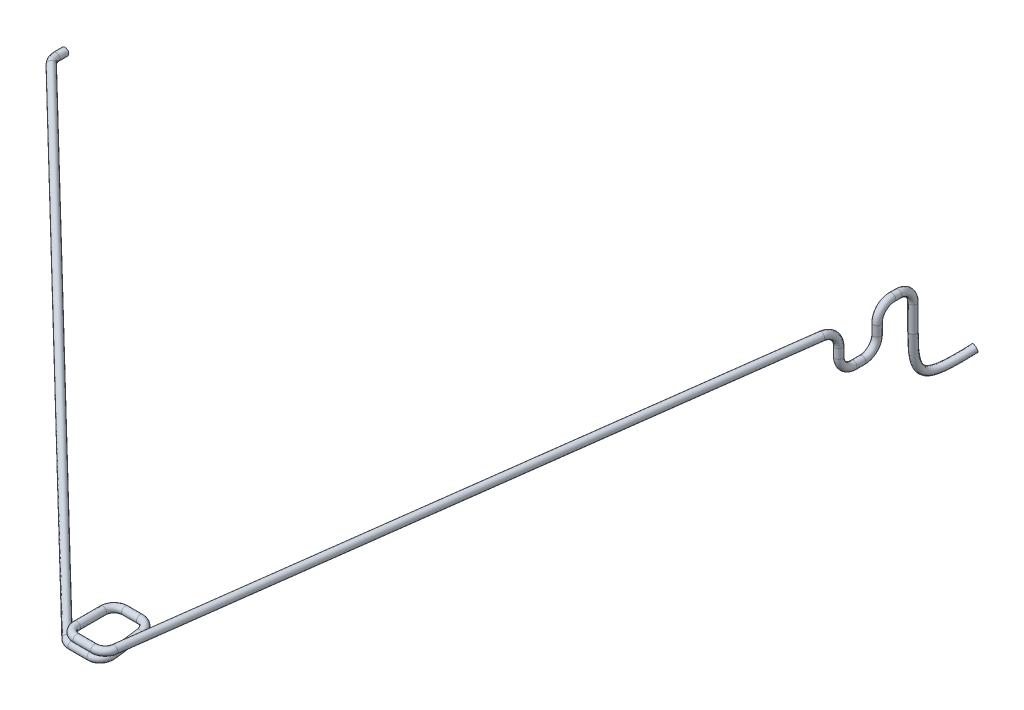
ISO-10303-21;
HEADER;
FILE_DESCRIPTION(('STEP AP214'),'2;1');
FILE_NAME('part.step','',(''),(''),'','','');
FILE_SCHEMA(('AUTOMOTIVE_DESIGN { 1 0 10303 214 1 1 1 1 }'));
ENDSEC;
DATA;
#1=APPLICATION_CONTEXT('core data for automotive mechanical design processes');
#2=APPLICATION_PROTOCOL_DEFINITION('international standard','automotive_design',2000,#1);
#3=PRODUCT_CONTEXT('',#1,'mechanical');
#4=PRODUCT('Part','Part','',(#3));
#5=PRODUCT_RELATED_PRODUCT_CATEGORY('part','',(#4));
#6=PRODUCT_DEFINITION_FORMATION('','',#4);
#7=PRODUCT_DEFINITION_CONTEXT('part definition',#1,'design');
#8=PRODUCT_DEFINITION('design','',#6,#7);
#9=PRODUCT_DEFINITION_SHAPE('','',#8);
#10=(LENGTH_UNIT() NAMED_UNIT(*) SI_UNIT(.MILLI.,.METRE.));
#11=(NAMED_UNIT(*) PLANE_ANGLE_UNIT() SI_UNIT($,.RADIAN.));
#12=(NAMED_UNIT(*) SI_UNIT($,.STERADIAN.) SOLID_ANGLE_UNIT());
#13=UNCERTAINTY_MEASURE_WITH_UNIT(LENGTH_MEASURE(1.E-05),#10,'distance_accuracy_value','');
#14=(GEOMETRIC_REPRESENTATION_CONTEXT(3) GLOBAL_UNCERTAINTY_ASSIGNED_CONTEXT((#13)) GLOBAL_UNIT_ASSIGNED_CONTEXT((#10,
#11,#12)) REPRESENTATION_CONTEXT('',''));
#15=CARTESIAN_POINT('',(0.,0.,0.));
#16=DIRECTION('',(0.,0.,1.));
#17=DIRECTION('',(1.,0.,0.));
#18=AXIS2_PLACEMENT_3D('',#15,#16,#17);
#19=CARTESIAN_POINT('',(278.397258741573,11.9978166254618,53.5192132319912));
#20=DIRECTION('',(0.,-1.,0.));
#21=DIRECTION('',(0.,0.,-1.));
#22=AXIS2_PLACEMENT_3D('',#19,#20,#21);
#23=CYLINDRICAL_SURFACE('',#22,1.00000000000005);
#24=CARTESIAN_POINT('',(278.397258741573,11.9978166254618,53.5192132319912));
#25=DIRECTION('',(1.22196340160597E-13,1.,-6.34587028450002E-13));
#26=DIRECTION('',(0.,6.34587028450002E-13,1.));
#27=AXIS2_PLACEMENT_3D('',#24,#25,#26);
#28=CIRCLE('',#27,1.00000000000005);
#29=CARTESIAN_POINT('',(278.397258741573,11.9978166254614,52.5192132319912));
#30=VERTEX_POINT('',#29);
#31=EDGE_CURVE('E32',#30,#30,#28,.T.);
#32=ORIENTED_EDGE('',*,*,#31,.F.);
#33=EDGE_LOOP('',(#32));
#34=FACE_BOUND('',#33,.T.);
#35=CARTESIAN_POINT('',(278.397258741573,5.19926221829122,53.5192132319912));
#36=DIRECTION('',(-0.0227539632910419,-0.999319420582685,-0.0290336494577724));
#37=DIRECTION('',(0.616425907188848,-0.0368876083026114,0.786548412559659));
#38=AXIS2_PLACEMENT_3D('',#35,#36,#37);
#39=ELLIPSE('',#38,1.00068104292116,1.00000000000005);
#40=CARTESIAN_POINT('',(279.014104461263,5.1623494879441,54.3062973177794));
#41=VERTEX_POINT('',#40);
#42=EDGE_CURVE('E11',#41,#41,#39,.T.);
#43=ORIENTED_EDGE('',*,*,#42,.F.);
#44=EDGE_LOOP('',(#43));
#45=FACE_BOUND('',#44,.T.);
#46=ADVANCED_FACE('F26',(#34,#45),#23,.T.);
#47=CARTESIAN_POINT('',(278.397258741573,11.9978166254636,57.5192132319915));
#48=DIRECTION('',(-1.,0.,0.));
#49=DIRECTION('',(0.,0.,1.));
#50=AXIS2_PLACEMENT_3D('',#47,#48,#49);
#51=TOROIDAL_SURFACE('',#50,4.00000000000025,1.00000000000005);
#52=CARTESIAN_POINT('',(278.397258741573,15.9978166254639,57.5192132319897));
#53=DIRECTION('',(1.22196340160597E-13,6.34648258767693E-13,1.));
#54=DIRECTION('',(0.,-1.,6.34648258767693E-13));
#55=AXIS2_PLACEMENT_3D('',#52,#53,#54);
#56=CIRCLE('',#55,1.00000000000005);
#57=CARTESIAN_POINT('',(278.397258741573,16.9978166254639,57.5192132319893));
#58=VERTEX_POINT('',#57);
#59=EDGE_CURVE('E36',#58,#58,#56,.T.);
#60=CARTESIAN_POINT('',(278.397258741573,11.9978166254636,57.5192132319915));
#61=DIRECTION('',(-1.,0.,0.));
#62=DIRECTION('',(0.,0.,1.));
#63=AXIS2_PLACEMENT_3D('',#60,#61,#62);
#64=CIRCLE('',#63,5.0000000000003);
#65=EDGE_CURVE('',#58,#30,#64,.T.);
#66=ORIENTED_EDGE('',*,*,#59,.F.);
#67=ORIENTED_EDGE('',*,*,#31,.T.);
#68=ORIENTED_EDGE('',*,*,#65,.T.);
#69=ORIENTED_EDGE('',*,*,#65,.F.);
#70=EDGE_LOOP('',(#66,#68,#67,#69));
#71=FACE_BOUND('',#70,.T.);
#72=ADVANCED_FACE('F140',(#71),#51,.T.);
#73=CARTESIAN_POINT('',(278.397258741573,15.9978166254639,59.1950501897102));
#74=DIRECTION('',(0.,0.,-1.));
#75=DIRECTION('',(-1.,0.,0.));
#76=AXIS2_PLACEMENT_3D('',#73,#74,#75);
#77=CYLINDRICAL_SURFACE('',#76,1.00000000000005);
#78=CARTESIAN_POINT('',(278.397258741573,15.9978166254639,59.1950501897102));
#79=DIRECTION('',(1.22196340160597E-13,6.34648258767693E-13,1.));
#80=DIRECTION('',(0.,-1.,6.34648258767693E-13));
#81=AXIS2_PLACEMENT_3D('',#78,#79,#80);
#82=CIRCLE('',#81,1.00000000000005);
#83=CARTESIAN_POINT('',(278.397258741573,16.9978166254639,59.1950501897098));
#84=VERTEX_POINT('',#83);
#85=EDGE_CURVE('E40',#84,#84,#82,.T.);
#86=ORIENTED_EDGE('',*,*,#85,.F.);
#87=EDGE_LOOP('',(#86));
#88=FACE_BOUND('',#87,.T.);
#89=ORIENTED_EDGE('',*,*,#59,.T.);
#90=EDGE_LOOP('',(#89));
#91=FACE_BOUND('',#90,.T.);
#92=ADVANCED_FACE('F145',(#88,#91),#77,.T.);
#93=CARTESIAN_POINT('',(278.397258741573,11.9978166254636,59.1950501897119));
#94=DIRECTION('',(-1.,0.,0.));
#95=DIRECTION('',(0.,0.,1.));
#96=AXIS2_PLACEMENT_3D('',#93,#94,#95);
#97=TOROIDAL_SURFACE('',#96,4.00000000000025,1.00000000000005);
#98=CARTESIAN_POINT('',(278.397258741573,11.9978166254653,63.1950501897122));
#99=DIRECTION('',(1.22196340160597E-13,-1.,6.34709489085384E-13));
#100=DIRECTION('',(0.,-6.34709489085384E-13,-1.));
#101=AXIS2_PLACEMENT_3D('',#98,#99,#100);
#102=CIRCLE('',#101,1.00000000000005);
#103=CARTESIAN_POINT('',(278.397258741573,11.9978166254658,64.1950501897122));
#104=VERTEX_POINT('',#103);
#105=EDGE_CURVE('E45',#104,#104,#102,.T.);
#106=CARTESIAN_POINT('',(278.397258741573,11.9978166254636,59.1950501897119));
#107=DIRECTION('',(-1.,0.,0.));
#108=DIRECTION('',(0.,0.,1.));
#109=AXIS2_PLACEMENT_3D('',#106,#107,#108);
#110=CIRCLE('',#109,5.00000000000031);
#111=EDGE_CURVE('',#104,#84,#110,.T.);
#112=ORIENTED_EDGE('',*,*,#105,.F.);
#113=ORIENTED_EDGE('',*,*,#85,.T.);
#114=ORIENTED_EDGE('',*,*,#111,.T.);
#115=ORIENTED_EDGE('',*,*,#111,.F.);
#116=EDGE_LOOP('',(#112,#114,#113,#115));
#117=FACE_BOUND('',#116,.T.);
#118=ADVANCED_FACE('F151',(#117),#97,.T.);
#119=CARTESIAN_POINT('',(278.397258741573,9.34810350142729,63.1950501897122));
#120=DIRECTION('',(0.,1.,0.));
#121=DIRECTION('',(0.,0.,1.));
#122=AXIS2_PLACEMENT_3D('',#119,#120,#121);
#123=CYLINDRICAL_SURFACE('',#122,1.00000000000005);
#124=CARTESIAN_POINT('',(278.397258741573,9.34810350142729,63.1950501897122));
#125=DIRECTION('',(1.22196340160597E-13,-1.,6.34709489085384E-13));
#126=DIRECTION('',(0.,-6.34709489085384E-13,-1.));
#127=AXIS2_PLACEMENT_3D('',#124,#125,#126);
#128=CIRCLE('',#127,1.00000000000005);
#129=CARTESIAN_POINT('',(278.397258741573,9.34810350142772,62.1950501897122));
#130=VERTEX_POINT('',#129);
#131=EDGE_CURVE('E48',#130,#130,#128,.T.);
#132=ORIENTED_EDGE('',*,*,#131,.F.);
#133=EDGE_LOOP('',(#132));
#134=FACE_BOUND('',#133,.T.);
#135=ORIENTED_EDGE('',*,*,#105,.T.);
#136=EDGE_LOOP('',(#135));
#137=FACE_BOUND('',#136,.T.);
#138=ADVANCED_FACE('F158',(#134,#137),#123,.T.);
#139=CARTESIAN_POINT('',(278.397258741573,9.34810350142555,67.1950501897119));
#140=DIRECTION('',(1.,0.,0.));
#141=DIRECTION('',(0.,0.,-1.));
#142=AXIS2_PLACEMENT_3D('',#139,#140,#141);
#143=TOROIDAL_SURFACE('',#142,3.99999999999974,1.00000000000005);
#144=CARTESIAN_POINT('',(278.397258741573,5.34810350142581,67.1950501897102));
#145=DIRECTION('',(1.22196340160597E-13,6.34648258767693E-13,1.));
#146=DIRECTION('',(0.,-1.,6.34648258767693E-13));
#147=AXIS2_PLACEMENT_3D('',#144,#145,#146);
#148=CIRCLE('',#147,1.00000000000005);
#149=CARTESIAN_POINT('',(278.397258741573,4.34810350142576,67.1950501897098));
#150=VERTEX_POINT('',#149);
#151=EDGE_CURVE('E51',#150,#150,#148,.T.);
#152=CARTESIAN_POINT('',(278.397258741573,9.34810350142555,67.1950501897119));
#153=DIRECTION('',(1.,0.,0.));
#154=DIRECTION('',(0.,0.,-1.));
#155=AXIS2_PLACEMENT_3D('',#152,#153,#154);
#156=CIRCLE('',#155,4.99999999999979);
#157=EDGE_CURVE('',#150,#130,#156,.T.);
#158=ORIENTED_EDGE('',*,*,#151,.F.);
#159=ORIENTED_EDGE('',*,*,#131,.T.);
#160=ORIENTED_EDGE('',*,*,#157,.T.);
#161=ORIENTED_EDGE('',*,*,#157,.F.);
#162=EDGE_LOOP('',(#158,#160,#159,#161));
#163=FACE_BOUND('',#162,.T.);
#164=ADVANCED_FACE('F162',(#163),#143,.T.);
#165=CARTESIAN_POINT('',(278.397258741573,5.34810350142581,69.5490338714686));
#166=DIRECTION('',(0.,0.,-1.));
#167=DIRECTION('',(0.,1.,0.));
#168=AXIS2_PLACEMENT_3D('',#165,#166,#167);
#169=CYLINDRICAL_SURFACE('',#168,1.00000000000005);
#170=CARTESIAN_POINT('',(278.397258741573,5.34810350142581,69.5490338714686));
#171=DIRECTION('',(1.22196340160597E-13,6.34648258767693E-13,1.));
#172=DIRECTION('',(0.,-1.,6.34648258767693E-13));
#173=AXIS2_PLACEMENT_3D('',#170,#171,#172);
#174=CIRCLE('',#173,1.00000000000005);
#175=CARTESIAN_POINT('',(278.397258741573,4.34810350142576,69.5490338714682));
#176=VERTEX_POINT('',#175);
#177=EDGE_CURVE('E54',#176,#176,#174,.T.);
#178=ORIENTED_EDGE('',*,*,#177,.F.);
#179=EDGE_LOOP('',(#178));
#180=FACE_BOUND('',#179,.T.);
#181=ORIENTED_EDGE('',*,*,#151,.T.);
#182=EDGE_LOOP('',(#181));
#183=FACE_BOUND('',#182,.T.);
#184=ADVANCED_FACE('F166',(#180,#183),#169,.T.);
#185=CARTESIAN_POINT('',(278.397258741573,9.34810350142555,69.5490338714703));
#186=DIRECTION('',(1.,0.,0.));
#187=DIRECTION('',(0.,0.,-1.));
#188=AXIS2_PLACEMENT_3D('',#185,#186,#187);
#189=TOROIDAL_SURFACE('',#188,3.99999999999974,1.00000000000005);
#190=CARTESIAN_POINT('',(278.397258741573,9.34810350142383,73.5490338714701));
#191=DIRECTION('',(1.22196340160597E-13,1.,-6.34587028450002E-13));
#192=DIRECTION('',(0.,6.34587028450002E-13,1.));
#193=AXIS2_PLACEMENT_3D('',#190,#191,#192);
#194=CIRCLE('',#193,1.00000000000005);
#195=CARTESIAN_POINT('',(278.397258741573,9.3481035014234,74.5490338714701));
#196=VERTEX_POINT('',#195);
#197=EDGE_CURVE('E57',#196,#196,#194,.T.);
#198=CARTESIAN_POINT('',(278.397258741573,9.34810350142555,69.5490338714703));
#199=DIRECTION('',(1.,0.,0.));
#200=DIRECTION('',(0.,0.,-1.));
#201=AXIS2_PLACEMENT_3D('',#198,#199,#200);
#202=CIRCLE('',#201,4.99999999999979);
#203=EDGE_CURVE('',#196,#176,#202,.T.);
#204=ORIENTED_EDGE('',*,*,#197,.F.);
#205=ORIENTED_EDGE('',*,*,#177,.T.);
#206=ORIENTED_EDGE('',*,*,#203,.T.);
#207=ORIENTED_EDGE('',*,*,#203,.F.);
#208=EDGE_LOOP('',(#204,#206,#205,#207));
#209=FACE_BOUND('',#208,.T.);
#210=ADVANCED_FACE('F170',(#209),#189,.T.);
#211=CARTESIAN_POINT('',(278.397258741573,11.8042011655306,73.5490338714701));
#212=DIRECTION('',(0.,-1.,0.));
#213=DIRECTION('',(0.,0.,-1.));
#214=AXIS2_PLACEMENT_3D('',#211,#212,#213);
#215=CYLINDRICAL_SURFACE('',#214,1.00000000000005);
#216=CARTESIAN_POINT('',(278.397258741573,11.8042011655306,73.5490338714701));
#217=DIRECTION('',(1.22196340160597E-13,1.,-6.34587028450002E-13));
#218=DIRECTION('',(0.,6.34587028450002E-13,1.));
#219=AXIS2_PLACEMENT_3D('',#216,#217,#218);
#220=CIRCLE('',#219,1.00000000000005);
#221=CARTESIAN_POINT('',(278.397258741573,11.8042011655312,74.5490338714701));
#222=VERTEX_POINT('',#221);
#223=EDGE_CURVE('E118',#222,#222,#220,.T.);
#224=ORIENTED_EDGE('',*,*,#223,.F.);
#225=EDGE_LOOP('',(#224));
#226=FACE_BOUND('',#225,.T.);
#227=ORIENTED_EDGE('',*,*,#197,.T.);
#228=EDGE_LOOP('',(#227));
#229=FACE_BOUND('',#228,.T.);
#230=ADVANCED_FACE('F174',(#226,#229),#215,.T.);
#231=CARTESIAN_POINT('',(251.425117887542,11.5914773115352,241.853934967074));
#232=DIRECTION('',(0.158703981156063,0.0253081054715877,-0.987001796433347));
#233=DIRECTION('',(-0.987318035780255,0.,-0.158754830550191));
#234=AXIS2_PLACEMENT_3D('',#231,#232,#233);
#235=CYLINDRICAL_SURFACE('',#234,1.00000000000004);
#236=CARTESIAN_POINT('',(251.425117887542,11.5914773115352,241.853934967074));
#237=DIRECTION('',(-0.158703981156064,-0.0253081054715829,0.987001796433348));
#238=DIRECTION('',(0.939511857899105,0.303454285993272,0.158848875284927));
#239=AXIS2_PLACEMENT_3D('',#236,#237,#238);
#240=CIRCLE('',#239,1.00000000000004);
#241=CARTESIAN_POINT('',(252.412444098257,11.5874092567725,242.012586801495));
#242=VERTEX_POINT('',#241);
#243=EDGE_CURVE('E63',#242,#242,#240,.T.);
#244=ORIENTED_EDGE('',*,*,#243,.F.);
#245=EDGE_LOOP('',(#244));
#246=FACE_BOUND('',#245,.T.);
#247=CARTESIAN_POINT('',(277.837007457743,15.803311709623,77.5947761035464));
#248=DIRECTION('',(0.147931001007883,0.0231991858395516,-0.988725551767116));
#249=DIRECTION('',(0.970329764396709,0.18991984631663,0.149634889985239));
#250=AXIS2_PLACEMENT_3D('',#247,#248,#249);
#251=ELLIPSE('',#250,1.00006174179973,1.00000000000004);
#252=CARTESIAN_POINT('',(278.807397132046,15.9932432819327,77.744420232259));
#253=VERTEX_POINT('',#252);
#254=EDGE_CURVE('E60',#253,#253,#251,.T.);
#255=ORIENTED_EDGE('',*,*,#254,.F.);
#256=EDGE_LOOP('',(#255));
#257=FACE_BOUND('',#256,.T.);
#258=ADVANCED_FACE('F178',(#246,#257),#235,.T.);
#259=CARTESIAN_POINT('',(248.463139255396,11.6036814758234,241.37797946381));
#260=DIRECTION('',(0.,0.999671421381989,0.0256329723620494));
#261=DIRECTION('',(0.,-0.0256329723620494,0.999671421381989));
#262=AXIS2_PLACEMENT_3D('',#259,#260,#261);
#263=TOROIDAL_SURFACE('',#262,2.9999999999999,1.00000000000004);
#264=CARTESIAN_POINT('',(248.463139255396,11.5267825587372,244.376993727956));
#265=DIRECTION('',(-1.,0.,0.));
#266=DIRECTION('',(0.,0.282933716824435,0.959139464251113));
#267=AXIS2_PLACEMENT_3D('',#264,#265,#266);
#268=CIRCLE('',#267,1.00000000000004);
#269=CARTESIAN_POINT('',(248.463139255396,11.5011495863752,245.376665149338));
#270=VERTEX_POINT('',#269);
#271=EDGE_CURVE('E66',#270,#270,#268,.T.);
#272=CARTESIAN_POINT('',(248.463139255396,11.6036814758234,241.37797946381));
#273=DIRECTION('',(0.,0.999671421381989,0.0256329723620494));
#274=DIRECTION('',(0.,-0.0256329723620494,0.999671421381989));
#275=AXIS2_PLACEMENT_3D('',#272,#273,#274);
#276=CIRCLE('',#275,3.99999999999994);
#277=EDGE_CURVE('',#270,#242,#276,.T.);
#278=ORIENTED_EDGE('',*,*,#271,.F.);
#279=ORIENTED_EDGE('',*,*,#243,.T.);
#280=ORIENTED_EDGE('',*,*,#277,.T.);
#281=ORIENTED_EDGE('',*,*,#277,.F.);
#282=EDGE_LOOP('',(#278,#280,#279,#281));
#283=FACE_BOUND('',#282,.T.);
#284=ADVANCED_FACE('F182',(#283),#263,.T.);
#285=CARTESIAN_POINT('',(243.707150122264,11.5267825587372,244.376993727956));
#286=DIRECTION('',(1.,0.,0.));
#287=DIRECTION('',(0.,1.,0.));
#288=AXIS2_PLACEMENT_3D('',#285,#286,#287);
#289=CYLINDRICAL_SURFACE('',#288,1.00000000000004);
#290=CARTESIAN_POINT('',(243.707150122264,11.5267825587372,244.376993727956));
#291=DIRECTION('',(-1.,0.,0.));
#292=DIRECTION('',(0.,0.282933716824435,0.959139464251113));
#293=AXIS2_PLACEMENT_3D('',#290,#291,#292);
#294=CIRCLE('',#293,1.00000000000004);
#295=CARTESIAN_POINT('',(243.707150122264,11.5267825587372,245.376993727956));
#296=VERTEX_POINT('',#295);
#297=EDGE_CURVE('E69',#296,#296,#294,.T.);
#298=ORIENTED_EDGE('',*,*,#297,.F.);
#299=EDGE_LOOP('',(#298));
#300=FACE_BOUND('',#299,.T.);
#301=ORIENTED_EDGE('',*,*,#271,.T.);
#302=EDGE_LOOP('',(#301));
#303=FACE_BOUND('',#302,.T.);
#304=ADVANCED_FACE('F186',(#300,#303),#289,.T.);
#305=CARTESIAN_POINT('',(243.707150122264,11.5267825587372,241.376993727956));
#306=DIRECTION('',(0.,1.,0.));
#307=DIRECTION('',(0.,0.,1.));
#308=AXIS2_PLACEMENT_3D('',#305,#306,#307);
#309=TOROIDAL_SURFACE('',#308,2.99999999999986,1.00000000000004);
#310=CARTESIAN_POINT('',(240.707150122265,11.5267825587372,241.376993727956));
#311=DIRECTION('',(0.,0.,-1.));
#312=DIRECTION('',(-0.959139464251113,0.282933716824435,0.));
#313=AXIS2_PLACEMENT_3D('',#310,#311,#312);
#314=CIRCLE('',#313,1.00000000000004);
#315=CARTESIAN_POINT('',(239.707150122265,11.5267825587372,241.376993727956));
#316=VERTEX_POINT('',#315);
#317=EDGE_CURVE('E72',#316,#316,#314,.T.);
#318=CARTESIAN_POINT('',(243.707150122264,11.5267825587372,241.376993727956));
#319=DIRECTION('',(0.,1.,0.));
#320=DIRECTION('',(0.,0.,1.));
#321=AXIS2_PLACEMENT_3D('',#318,#319,#320);
#322=CIRCLE('',#321,3.99999999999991);
#323=EDGE_CURVE('',#316,#296,#322,.T.);
#324=ORIENTED_EDGE('',*,*,#317,.F.);
#325=ORIENTED_EDGE('',*,*,#297,.T.);
#326=ORIENTED_EDGE('',*,*,#323,.T.);
#327=ORIENTED_EDGE('',*,*,#323,.F.);
#328=EDGE_LOOP('',(#324,#326,#325,#327));
#329=FACE_BOUND('',#328,.T.);
#330=ADVANCED_FACE('F190',(#329),#309,.T.);
#331=CARTESIAN_POINT('',(240.707150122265,11.5267825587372,234.309563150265));
#332=DIRECTION('',(0.,0.,1.));
#333=DIRECTION('',(0.,-1.,0.));
#334=AXIS2_PLACEMENT_3D('',#331,#332,#333);
#335=CYLINDRICAL_SURFACE('',#334,1.00000000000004);
#336=CARTESIAN_POINT('',(240.707150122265,11.5267825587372,234.309563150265));
#337=DIRECTION('',(0.,0.,-1.));
#338=DIRECTION('',(-0.959139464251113,0.282933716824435,0.));
#339=AXIS2_PLACEMENT_3D('',#336,#337,#338);
#340=CIRCLE('',#339,1.00000000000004);
#341=CARTESIAN_POINT('',(239.707150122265,11.5267825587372,234.309563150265));
#342=VERTEX_POINT('',#341);
#343=EDGE_CURVE('E75',#342,#342,#340,.T.);
#344=ORIENTED_EDGE('',*,*,#343,.F.);
#345=EDGE_LOOP('',(#344));
#346=FACE_BOUND('',#345,.T.);
#347=ORIENTED_EDGE('',*,*,#317,.T.);
#348=EDGE_LOOP('',(#347));
#349=FACE_BOUND('',#348,.T.);
#350=ADVANCED_FACE('F194',(#346,#349),#335,.T.);
#351=CARTESIAN_POINT('',(243.707150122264,11.5267825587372,234.309563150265));
#352=DIRECTION('',(0.,1.,0.));
#353=DIRECTION('',(0.,0.,1.));
#354=AXIS2_PLACEMENT_3D('',#351,#352,#353);
#355=TOROIDAL_SURFACE('',#354,2.99999999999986,1.00000000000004);
#356=CARTESIAN_POINT('',(243.707150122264,11.5267825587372,231.309563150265));
#357=DIRECTION('',(1.,0.,0.));
#358=DIRECTION('',(0.,0.282933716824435,-0.959139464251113));
#359=AXIS2_PLACEMENT_3D('',#356,#357,#358);
#360=CIRCLE('',#359,1.00000000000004);
#361=CARTESIAN_POINT('',(243.707150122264,11.5267825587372,230.309563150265));
#362=VERTEX_POINT('',#361);
#363=EDGE_CURVE('E78',#362,#362,#360,.T.);
#364=CARTESIAN_POINT('',(243.707150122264,11.5267825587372,234.309563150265));
#365=DIRECTION('',(0.,1.,0.));
#366=DIRECTION('',(0.,0.,1.));
#367=AXIS2_PLACEMENT_3D('',#364,#365,#366);
#368=CIRCLE('',#367,3.99999999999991);
#369=EDGE_CURVE('',#362,#342,#368,.T.);
#370=ORIENTED_EDGE('',*,*,#363,.F.);
#371=ORIENTED_EDGE('',*,*,#343,.T.);
#372=ORIENTED_EDGE('',*,*,#369,.T.);
#373=ORIENTED_EDGE('',*,*,#369,.F.);
#374=EDGE_LOOP('',(#370,#372,#371,#373));
#375=FACE_BOUND('',#374,.T.);
#376=ADVANCED_FACE('F198',(#375),#355,.T.);
#377=CARTESIAN_POINT('',(247.709994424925,11.5267825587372,231.309563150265));
#378=DIRECTION('',(-1.,0.,0.));
#379=DIRECTION('',(0.,0.,1.));
#380=AXIS2_PLACEMENT_3D('',#377,#378,#379);
#381=CYLINDRICAL_SURFACE('',#380,1.00000000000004);
#382=CARTESIAN_POINT('',(247.709994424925,11.5267825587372,231.309563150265));
#383=DIRECTION('',(1.,0.,0.));
#384=DIRECTION('',(0.,0.282933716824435,-0.959139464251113));
#385=AXIS2_PLACEMENT_3D('',#382,#383,#384);
#386=CIRCLE('',#385,1.00000000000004);
#387=CARTESIAN_POINT('',(247.709994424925,11.6689495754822,230.319720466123));
#388=VERTEX_POINT('',#387);
#389=EDGE_CURVE('E81',#388,#388,#386,.T.);
#390=ORIENTED_EDGE('',*,*,#389,.F.);
#391=EDGE_LOOP('',(#390));
#392=FACE_BOUND('',#391,.T.);
#393=ORIENTED_EDGE('',*,*,#363,.T.);
#394=EDGE_LOOP('',(#393));
#395=FACE_BOUND('',#394,.T.);
#396=ADVANCED_FACE('F202',(#392,#395),#381,.T.);
#397=CARTESIAN_POINT('',(247.709994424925,11.1002815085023,234.279091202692));
#398=DIRECTION('',(0.,0.989842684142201,0.142167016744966));
#399=DIRECTION('',(0.,-0.142167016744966,0.989842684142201));
#400=AXIS2_PLACEMENT_3D('',#397,#398,#399);
#401=TOROIDAL_SURFACE('',#400,2.99999999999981,1.00000000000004);
#402=CARTESIAN_POINT('',(250.709994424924,11.1002815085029,234.279091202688));
#403=DIRECTION('',(1.24284605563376E-12,-0.142167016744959,0.989842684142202));
#404=DIRECTION('',(0.989621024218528,0.142242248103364,0.0204296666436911));
#405=AXIS2_PLACEMENT_3D('',#402,#403,#404);
#406=CIRCLE('',#405,1.00000000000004);
#407=CARTESIAN_POINT('',(251.709994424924,11.100281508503,234.279091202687));
#408=VERTEX_POINT('',#407);
#409=EDGE_CURVE('E84',#408,#408,#406,.T.);
#410=CARTESIAN_POINT('',(247.709994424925,11.1002815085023,234.279091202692));
#411=DIRECTION('',(0.,0.989842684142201,0.142167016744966));
#412=DIRECTION('',(0.,-0.142167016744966,0.989842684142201));
#413=AXIS2_PLACEMENT_3D('',#410,#411,#412);
#414=CIRCLE('',#413,3.99999999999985);
#415=EDGE_CURVE('',#408,#388,#414,.T.);
#416=ORIENTED_EDGE('',*,*,#409,.F.);
#417=ORIENTED_EDGE('',*,*,#389,.T.);
#418=ORIENTED_EDGE('',*,*,#415,.T.);
#419=ORIENTED_EDGE('',*,*,#415,.F.);
#420=EDGE_LOOP('',(#416,#418,#417,#419));
#421=FACE_BOUND('',#420,.T.);
#422=ADVANCED_FACE('F206',(#421),#401,.T.);
#423=CARTESIAN_POINT('',(250.709994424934,10.034610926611,241.698858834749));
#424=DIRECTION('',(-1.25153445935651E-12,0.142167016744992,-0.989842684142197));
#425=DIRECTION('',(0.,0.989842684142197,0.142167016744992));
#426=AXIS2_PLACEMENT_3D('',#423,#424,#425);
#427=CYLINDRICAL_SURFACE('',#426,1.00000000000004);
#428=CARTESIAN_POINT('',(250.709994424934,10.034610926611,241.698858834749));
#429=DIRECTION('',(1.24284605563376E-12,-0.142167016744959,0.989842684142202));
#430=DIRECTION('',(0.989621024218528,0.142242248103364,0.0204296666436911));
#431=AXIS2_PLACEMENT_3D('',#428,#429,#430);
#432=CIRCLE('',#431,1.00000000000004);
#433=CARTESIAN_POINT('',(251.709994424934,10.0346109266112,241.698858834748));
#434=VERTEX_POINT('',#433);
#435=EDGE_CURVE('E87',#434,#434,#432,.T.);
#436=ORIENTED_EDGE('',*,*,#435,.F.);
#437=EDGE_LOOP('',(#436));
#438=FACE_BOUND('',#437,.T.);
#439=ORIENTED_EDGE('',*,*,#409,.T.);
#440=EDGE_LOOP('',(#439));
#441=FACE_BOUND('',#440,.T.);
#442=ADVANCED_FACE('F210',(#438,#441),#427,.T.);
#443=CARTESIAN_POINT('',(247.709994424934,10.0346109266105,241.698858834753));
#444=DIRECTION('',(0.,0.989842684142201,0.142167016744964));
#445=DIRECTION('',(0.,-0.142167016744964,0.989842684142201));
#446=AXIS2_PLACEMENT_3D('',#443,#444,#445);
#447=TOROIDAL_SURFACE('',#446,2.99999999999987,1.00000000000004);
#448=CARTESIAN_POINT('',(247.709994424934,9.60810987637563,244.668386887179));
#449=DIRECTION('',(-1.,0.,0.));
#450=DIRECTION('',(0.,0.00155077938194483,0.999998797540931));
#451=AXIS2_PLACEMENT_3D('',#448,#449,#450);
#452=CIRCLE('',#451,1.00000000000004);
#453=CARTESIAN_POINT('',(247.709994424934,9.46594285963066,245.658229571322));
#454=VERTEX_POINT('',#453);
#455=EDGE_CURVE('E90',#454,#454,#452,.T.);
#456=CARTESIAN_POINT('',(247.709994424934,10.0346109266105,241.698858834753));
#457=DIRECTION('',(0.,0.989842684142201,0.142167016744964));
#458=DIRECTION('',(0.,-0.142167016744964,0.989842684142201));
#459=AXIS2_PLACEMENT_3D('',#456,#457,#458);
#460=CIRCLE('',#459,3.99999999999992);
#461=EDGE_CURVE('',#454,#434,#460,.T.);
#462=ORIENTED_EDGE('',*,*,#455,.F.);
#463=ORIENTED_EDGE('',*,*,#435,.T.);
#464=ORIENTED_EDGE('',*,*,#461,.T.);
#465=ORIENTED_EDGE('',*,*,#461,.F.);
#466=EDGE_LOOP('',(#462,#464,#463,#465));
#467=FACE_BOUND('',#466,.T.);
#468=ADVANCED_FACE('F214',(#467),#447,.T.);
#469=CARTESIAN_POINT('',(242.619000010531,9.60810987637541,244.668386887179));
#470=DIRECTION('',(1.,0.,0.));
#471=DIRECTION('',(0.,1.,0.));
#472=AXIS2_PLACEMENT_3D('',#469,#470,#471);
#473=CYLINDRICAL_SURFACE('',#472,1.00000000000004);
#474=CARTESIAN_POINT('',(242.619000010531,9.60810987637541,244.668386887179));
#475=DIRECTION('',(-1.,0.,0.));
#476=DIRECTION('',(0.,0.00155077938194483,0.999998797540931));
#477=AXIS2_PLACEMENT_3D('',#474,#475,#476);
#478=CIRCLE('',#477,1.00000000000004);
#479=CARTESIAN_POINT('',(242.619000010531,9.61361326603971,245.668371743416));
#480=VERTEX_POINT('',#479);
#481=EDGE_CURVE('E93',#480,#480,#478,.T.);
#482=ORIENTED_EDGE('',*,*,#481,.F.);
#483=EDGE_LOOP('',(#482));
#484=FACE_BOUND('',#483,.T.);
#485=ORIENTED_EDGE('',*,*,#455,.T.);
#486=EDGE_LOOP('',(#485));
#487=FACE_BOUND('',#486,.T.);
#488=ADVANCED_FACE('F218',(#484,#487),#473,.T.);
#489=CARTESIAN_POINT('',(242.619000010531,9.59159970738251,241.66843231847));
#490=DIRECTION('',(0.,0.999984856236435,-0.00550338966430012));
#491=DIRECTION('',(0.,0.00550338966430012,0.999984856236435));
#492=AXIS2_PLACEMENT_3D('',#489,#490,#491);
#493=TOROIDAL_SURFACE('',#492,2.99999999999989,1.00000000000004);
#494=CARTESIAN_POINT('',(240.531525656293,9.6034575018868,243.823034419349));
#495=DIRECTION('',(-0.718211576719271,-0.00382939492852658,-0.69581424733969));
#496=DIRECTION('',(-0.695819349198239,0.,0.718216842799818));
#497=AXIS2_PLACEMENT_3D('',#494,#495,#496);
#498=CIRCLE('',#497,1.00000000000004);
#499=CARTESIAN_POINT('',(239.835700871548,9.6074101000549,244.541235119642));
#500=VERTEX_POINT('',#499);
#501=EDGE_CURVE('E112',#500,#500,#498,.T.);
#502=CARTESIAN_POINT('',(242.619000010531,9.59159970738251,241.66843231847));
#503=DIRECTION('',(0.,0.999984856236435,-0.00550338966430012));
#504=DIRECTION('',(0.,0.00550338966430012,0.999984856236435));
#505=AXIS2_PLACEMENT_3D('',#502,#503,#504);
#506=CIRCLE('',#505,3.99999999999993);
#507=EDGE_CURVE('',#500,#480,#506,.T.);
#508=ORIENTED_EDGE('',*,*,#501,.F.);
#509=ORIENTED_EDGE('',*,*,#481,.T.);
#510=ORIENTED_EDGE('',*,*,#507,.T.);
#511=ORIENTED_EDGE('',*,*,#507,.F.);
#512=EDGE_LOOP('',(#508,#510,#509,#511));
#513=FACE_BOUND('',#512,.T.);
#514=ADVANCED_FACE('F222',(#513),#493,.T.);
#515=CARTESIAN_POINT('',(102.373994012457,8.84428654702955,106.20562378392));
#516=DIRECTION('',(0.,0.,-1.));
#517=DIRECTION('',(-1.,0.,0.));
#518=AXIS2_PLACEMENT_3D('',#515,#516,#517);
#519=PLANE('',#518);
#520=CARTESIAN_POINT('',(102.373994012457,8.84428654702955,106.20562378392));
#521=DIRECTION('',(0.,0.,-1.));
#522=DIRECTION('',(-1.,0.,0.));
#523=AXIS2_PLACEMENT_3D('',#520,#521,#522);
#524=CIRCLE('',#523,0.999999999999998);
#525=CARTESIAN_POINT('',(101.373994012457,8.84428654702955,106.20562378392));
#526=VERTEX_POINT('',#525);
#527=EDGE_CURVE('E96',#526,#526,#524,.T.);
#528=ORIENTED_EDGE('',*,*,#527,.T.);
#529=EDGE_LOOP('',(#528));
#530=FACE_BOUND('',#529,.T.);
#531=ADVANCED_FACE('F226',(#530),#519,.T.);
#532=CARTESIAN_POINT('',(102.373994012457,8.84428654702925,111.438377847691));
#533=DIRECTION('',(0.,0.,-1.));
#534=DIRECTION('',(0.,1.,0.));
#535=AXIS2_PLACEMENT_3D('',#532,#533,#534);
#536=CYLINDRICAL_SURFACE('',#535,0.999999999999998);
#537=ORIENTED_EDGE('',*,*,#527,.F.);
#538=EDGE_LOOP('',(#537));
#539=FACE_BOUND('',#538,.T.);
#540=CARTESIAN_POINT('',(103.373721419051,8.86763419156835,108.566870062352));
#541=CARTESIAN_POINT('',(103.420416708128,6.86817937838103,108.566870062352));
#542=CARTESIAN_POINT('',(101.420961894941,6.82148408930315,108.653031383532));
#543=CARTESIAN_POINT('',(101.374266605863,8.82093890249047,108.653031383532));
#544=CARTESIAN_POINT('',(101.327571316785,10.8203937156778,108.653031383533));
#545=CARTESIAN_POINT('',(103.327026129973,10.8670890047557,108.566870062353));
#546=CARTESIAN_POINT('',(103.373721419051,8.86763419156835,108.566870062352));
#547=(BOUNDED_CURVE() B_SPLINE_CURVE(3,(#540,#541,#542,#543,#544,#545,#546),.UNSPECIFIED.,.T.,
.F.) B_SPLINE_CURVE_WITH_KNOTS((4,3,4),(0.,0.5,1.),
.UNSPECIFIED.) CURVE() GEOMETRIC_REPRESENTATION_ITEM() RATIONAL_B_SPLINE_CURVE((1.,
0.333333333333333,0.333333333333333,1.,0.333333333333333,0.333333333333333,1.)) REPRESENTATION_ITEM(''));
#548=CARTESIAN_POINT('',(103.373721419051,8.86763419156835,108.566870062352));
#549=VERTEX_POINT('',#548);
#550=EDGE_CURVE('E104',#549,#549,#547,.T.);
#551=ORIENTED_EDGE('',*,*,#550,.T.);
#552=EDGE_LOOP('',(#551));
#553=FACE_BOUND('',#552,.T.);
#554=ADVANCED_FACE('F228',(#539,#553),#536,.T.);
#555=CARTESIAN_POINT('',(103.373721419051,8.86763419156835,108.566870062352));
#556=CARTESIAN_POINT('',(103.39235876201,8.868069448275,108.782835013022));
#557=CARTESIAN_POINT('',(103.441168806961,8.86920935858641,108.985881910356));
#558=CARTESIAN_POINT('',(103.625952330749,8.8735247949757,109.55540597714));
#559=CARTESIAN_POINT('',(103.941951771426,8.88090464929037,110.056807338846));
#560=CARTESIAN_POINT('',(104.125426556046,8.88518952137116,110.284611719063));
#561=CARTESIAN_POINT('',(104.314049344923,8.88959461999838,110.461325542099));
#562=CARTESIAN_POINT('',(103.420416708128,6.86817937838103,108.566870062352));
#563=CARTESIAN_POINT('',(103.456984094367,6.86903337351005,108.99060394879));
#564=CARTESIAN_POINT('',(103.481961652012,6.86961669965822,108.871065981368));
#565=CARTESIAN_POINT('',(103.657220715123,6.87370970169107,109.569545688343));
#566=CARTESIAN_POINT('',(104.050247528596,6.8828884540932,110.105938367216));
#567=CARTESIAN_POINT('',(104.024862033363,6.88229560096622,110.146649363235));
#568=CARTESIAN_POINT('',(104.351301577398,6.88991927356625,110.452478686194));
#569=CARTESIAN_POINT('',(101.420961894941,6.82148408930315,108.653031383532));
#570=CARTESIAN_POINT('',(101.45752928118,6.82233808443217,109.07676526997));
#571=CARTESIAN_POINT('',(101.548820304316,6.82447009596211,109.508381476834));
#572=CARTESIAN_POINT('',(101.848171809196,6.83146115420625,110.410094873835));
#573=CARTESIAN_POINT('',(102.382428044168,6.84393818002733,111.255153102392));
#574=CARTESIAN_POINT('',(102.645672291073,6.85008598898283,111.594781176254));
#575=CARTESIAN_POINT('',(102.972111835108,6.85770966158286,111.900610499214));
#576=CARTESIAN_POINT('',(101.374266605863,8.82093890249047,108.653031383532));
#577=CARTESIAN_POINT('',(101.401868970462,8.8215835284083,108.972880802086));
#578=CARTESIAN_POINT('',(101.504936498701,8.82399056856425,109.565658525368));
#579=CARTESIAN_POINT('',(101.80977067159,8.83110966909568,110.403569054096));
#580=CARTESIAN_POINT('',(102.302931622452,8.84262695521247,111.22871301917));
#581=CARTESIAN_POINT('',(102.677328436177,8.85137062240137,111.668185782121));
#582=CARTESIAN_POINT('',(102.934859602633,8.85738500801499,111.909457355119));
#583=CARTESIAN_POINT('',(101.327571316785,10.8203937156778,108.653031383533));
#584=CARTESIAN_POINT('',(101.346208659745,10.8208289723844,108.868996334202));
#585=CARTESIAN_POINT('',(101.461052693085,10.8235110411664,109.622935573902));
#586=CARTESIAN_POINT('',(101.771369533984,10.8307581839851,110.397043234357));
#587=CARTESIAN_POINT('',(102.223435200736,10.8413157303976,111.202272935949));
#588=CARTESIAN_POINT('',(102.708984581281,10.8526552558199,111.741590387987));
#589=CARTESIAN_POINT('',(102.897607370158,10.8570603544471,111.918304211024));
#590=CARTESIAN_POINT('',(103.327026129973,10.8670890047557,108.566870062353));
#591=CARTESIAN_POINT('',(103.327733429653,10.86710552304,108.575066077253));
#592=CARTESIAN_POINT('',(103.40037596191,10.8688020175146,109.100697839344));
#593=CARTESIAN_POINT('',(103.594683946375,10.8733398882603,109.541266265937));
#594=CARTESIAN_POINT('',(103.833656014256,10.8789208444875,110.007676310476));
#595=CARTESIAN_POINT('',(104.22599107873,10.8880834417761,110.42257407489));
#596=CARTESIAN_POINT('',(104.276797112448,10.8892699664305,110.470172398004));
#597=CARTESIAN_POINT('',(103.373721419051,8.86763419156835,108.566870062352));
#598=CARTESIAN_POINT('',(103.39235876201,8.868069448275,108.782835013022));
#599=CARTESIAN_POINT('',(103.441168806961,8.86920935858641,108.985881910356));
#600=CARTESIAN_POINT('',(103.625952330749,8.8735247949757,109.55540597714));
#601=CARTESIAN_POINT('',(103.941951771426,8.88090464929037,110.056807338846));
#602=CARTESIAN_POINT('',(104.125426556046,8.88518952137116,110.284611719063));
#603=CARTESIAN_POINT('',(104.314049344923,8.88959461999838,110.461325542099));
#604=(BOUNDED_SURFACE() B_SPLINE_SURFACE(3,3,((#555,#556,#557,#558,#559,#560,#561),(#562,#563,
#564,#565,#566,#567,#568),(#569,#570,#571,#572,#573,#574,#575),(#576,#577,#578,#579,#580,#581,
#582),(#583,#584,#585,#586,#587,#588,#589),(#590,#591,#592,#593,#594,#595,#596),(#597,#598,#599,
#600,#601,#602,#603)),.UNSPECIFIED.,.T.,.F.,.F.) B_SPLINE_SURFACE_WITH_KNOTS((4,3,4),(4,1,1,1,
4),(0.,0.5,1.),(0.,0.220559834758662,0.489427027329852,0.733933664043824,1.),
.UNSPECIFIED.) GEOMETRIC_REPRESENTATION_ITEM() RATIONAL_B_SPLINE_SURFACE(((1.,1.,1.,1.,1.,1.,
1.),(0.333333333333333,0.333333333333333,0.333333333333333,0.333333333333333,0.333333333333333,
0.333333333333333,0.333333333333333),(0.333333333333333,0.333333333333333,0.333333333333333,
0.333333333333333,0.333333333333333,0.333333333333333,0.333333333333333),(1.,1.,1.,1.,1.,1.,1.),
(0.333333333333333,0.333333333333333,0.333333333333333,0.333333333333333,0.333333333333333,
0.333333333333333,0.333333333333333),(0.333333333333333,0.333333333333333,0.333333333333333,
0.333333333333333,0.333333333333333,0.333333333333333,0.333333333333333),(1.,1.,1.,1.,1.,1.,1.))) REPRESENTATION_ITEM('') SURFACE());
#605=CARTESIAN_POINT('',(104.314049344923,8.88959461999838,110.461325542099));
#606=CARTESIAN_POINT('',(104.351301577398,6.88991927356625,110.452478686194));
#607=CARTESIAN_POINT('',(102.972111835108,6.85770966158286,111.900610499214));
#608=CARTESIAN_POINT('',(102.934859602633,8.85738500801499,111.909457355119));
#609=CARTESIAN_POINT('',(102.897607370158,10.8570603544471,111.918304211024));
#610=CARTESIAN_POINT('',(104.276797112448,10.8892699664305,110.470172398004));
#611=CARTESIAN_POINT('',(104.314049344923,8.88959461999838,110.461325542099));
#612=(BOUNDED_CURVE() B_SPLINE_CURVE(3,(#605,#606,#607,#608,#609,#610,#611),.UNSPECIFIED.,.T.,
.F.) B_SPLINE_CURVE_WITH_KNOTS((4,3,4),(0.,0.5,1.),
.UNSPECIFIED.) CURVE() GEOMETRIC_REPRESENTATION_ITEM() RATIONAL_B_SPLINE_CURVE((1.,
0.333333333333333,0.333333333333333,1.,0.333333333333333,0.333333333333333,1.)) REPRESENTATION_ITEM(''));
#613=CARTESIAN_POINT('',(104.314049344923,8.88959461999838,110.461325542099));
#614=VERTEX_POINT('',#613);
#615=EDGE_CURVE('E99',#614,#614,#612,.F.);
#616=ORIENTED_EDGE('',*,*,#550,.F.);
#617=EDGE_LOOP('',(#616));
#618=FACE_BOUND('',#617,.T.);
#619=ORIENTED_EDGE('',*,*,#615,.F.);
#620=EDGE_LOOP('',(#619));
#621=FACE_BOUND('',#620,.T.);
#622=ADVANCED_FACE('F231',(#618,#621),#604,.F.);
#623=CARTESIAN_POINT('',(104.314049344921,8.88959461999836,110.461325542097));
#624=CARTESIAN_POINT('',(241.227210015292,9.61959477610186,243.10486810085));
#625=CARTESIAN_POINT('',(104.276797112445,10.8892699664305,110.470172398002));
#626=CARTESIAN_POINT('',(241.199252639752,11.619319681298,243.122719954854));
#627=CARTESIAN_POINT('',(102.897607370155,10.8570603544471,111.918304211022));
#628=CARTESIAN_POINT('',(239.807883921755,11.5870451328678,244.559052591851));
#629=CARTESIAN_POINT('',(102.934859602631,8.85738500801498,111.909457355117));
#630=CARTESIAN_POINT('',(239.835841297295,9.58732022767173,244.541200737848));
#631=CARTESIAN_POINT('',(102.972111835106,6.85770966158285,111.900610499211));
#632=CARTESIAN_POINT('',(239.863798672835,7.58759532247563,244.523348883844));
#633=CARTESIAN_POINT('',(104.351301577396,6.88991927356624,110.452478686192));
#634=CARTESIAN_POINT('',(241.255167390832,7.61986987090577,243.087016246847));
#635=CARTESIAN_POINT('',(104.314049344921,8.88959461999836,110.461325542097));
#636=CARTESIAN_POINT('',(241.227210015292,9.61959477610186,243.10486810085));
#637=(BOUNDED_SURFACE() B_SPLINE_SURFACE(3,1,((#623,#624),(#625,#626),(#627,#628),(#629,#630),
(#631,#632),(#633,#634),(#635,#636)),.UNSPECIFIED.,.T.,.F.,.F.) B_SPLINE_SURFACE_WITH_KNOTS((4,
3,4),(2,2),(0.,0.5,1.),(0.,1.),
.UNSPECIFIED.) GEOMETRIC_REPRESENTATION_ITEM() RATIONAL_B_SPLINE_SURFACE(((1.,1.),
(0.333333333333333,0.333333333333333),(0.333333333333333,0.333333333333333),(1.,1.),
(0.333333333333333,0.333333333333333),(0.333333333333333,0.333333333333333),(1.,1.))) REPRESENTATION_ITEM('') SURFACE());
#638=ORIENTED_EDGE('',*,*,#615,.T.);
#639=EDGE_LOOP('',(#638));
#640=FACE_BOUND('',#639,.T.);
#641=ORIENTED_EDGE('',*,*,#501,.T.);
#642=EDGE_LOOP('',(#641));
#643=FACE_BOUND('',#642,.T.);
#644=ADVANCED_FACE('F136',(#640,#643),#637,.T.);
#645=CARTESIAN_POINT('',(278.807397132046,15.9932432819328,77.7444202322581));
#646=CARTESIAN_POINT('',(278.845654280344,15.999125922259,77.4681539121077));
#647=CARTESIAN_POINT('',(278.928432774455,15.9523396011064,76.8703856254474));
#648=CARTESIAN_POINT('',(279.035275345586,15.7183999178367,76.0988434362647));
#649=CARTESIAN_POINT('',(279.128623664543,15.3692254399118,75.4247472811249));
#650=CARTESIAN_POINT('',(279.204469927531,14.9488822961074,74.877038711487));
#651=CARTESIAN_POINT('',(279.264116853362,14.4953366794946,74.4463104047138));
#652=CARTESIAN_POINT('',(279.31175385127,14.0115162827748,74.1023093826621));
#653=CARTESIAN_POINT('',(279.347611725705,13.5146720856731,73.8433689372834));
#654=CARTESIAN_POINT('',(279.372409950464,13.0213459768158,73.664293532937));
#655=CARTESIAN_POINT('',(279.387068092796,12.5724761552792,73.5584426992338));
#656=CARTESIAN_POINT('',(279.394361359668,12.1758983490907,73.5057758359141));
#657=CARTESIAN_POINT('',(279.395813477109,11.9164881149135,73.4952896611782));
#658=CARTESIAN_POINT('',(279.395813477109,11.8042011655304,73.4952896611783));
#659=CARTESIAN_POINT('',(279.18989715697,14.0301923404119,77.7555885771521));
#660=CARTESIAN_POINT('',(279.221181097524,14.0350027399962,77.5296778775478));
#661=CARTESIAN_POINT('',(279.250475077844,14.0078808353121,77.3181372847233));
#662=CARTESIAN_POINT('',(279.312773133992,13.8844097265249,76.8682643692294));
#663=CARTESIAN_POINT('',(279.361065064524,13.6986591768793,76.5195338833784));
#664=CARTESIAN_POINT('',(279.401677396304,13.4753103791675,76.2262600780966));
#665=CARTESIAN_POINT('',(279.433303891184,13.2343486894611,75.9978756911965));
#666=CARTESIAN_POINT('',(279.458635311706,12.9770154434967,75.8149499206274));
#667=CARTESIAN_POINT('',(279.477686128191,12.713833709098,75.6773782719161));
#668=CARTESIAN_POINT('',(279.490865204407,12.4489644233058,75.5822082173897));
#669=CARTESIAN_POINT('',(279.498654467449,12.2187281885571,75.5259596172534));
#670=CARTESIAN_POINT('',(279.502530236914,11.9824419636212,75.4979715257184));
#671=CARTESIAN_POINT('',(279.503301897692,11.9004696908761,75.4923991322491));
#672=CARTESIAN_POINT('',(279.503301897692,11.8042011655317,75.4923991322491));
#673=CARTESIAN_POINT('',(277.249117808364,13.6503291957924,77.4563003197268));
#674=CARTESIAN_POINT('',(277.280401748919,13.6551395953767,77.2303896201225));
#675=CARTESIAN_POINT('',(277.293020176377,13.6308568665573,77.1392681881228));
#676=CARTESIAN_POINT('',(277.349059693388,13.529153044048,76.7345900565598));
#677=CARTESIAN_POINT('',(277.38805751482,13.3749788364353,76.4529751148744));
#678=CARTESIAN_POINT('',(277.421975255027,13.1898152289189,76.20804495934));
#679=CARTESIAN_POINT('',(277.448142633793,12.9900417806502,76.0190824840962));
#680=CARTESIAN_POINT('',(277.469159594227,12.7765710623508,75.8673127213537));
#681=CARTESIAN_POINT('',(277.484952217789,12.5587318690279,75.753269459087));
#682=CARTESIAN_POINT('',(277.495880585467,12.337895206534,75.6743524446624));
#683=CARTESIAN_POINT('',(277.502338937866,12.1507218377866,75.6277147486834));
#684=CARTESIAN_POINT('',(277.505552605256,11.9433255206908,75.6045078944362));
#685=CARTESIAN_POINT('',(277.506192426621,11.9004696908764,75.5998875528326));
#686=CARTESIAN_POINT('',(277.506192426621,11.804201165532,75.5998875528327));
#687=CARTESIAN_POINT('',(276.866617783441,15.6133801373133,77.4451319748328));
#688=CARTESIAN_POINT('',(276.901388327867,15.6187266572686,77.1940434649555));
#689=CARTESIAN_POINT('',(276.972495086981,15.5755488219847,76.6805602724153));
#690=CARTESIAN_POINT('',(277.071199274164,15.3630878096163,75.9677877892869));
#691=CARTESIAN_POINT('',(277.155701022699,15.0455570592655,75.3575753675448));
#692=CARTESIAN_POINT('',(277.224748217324,14.6633876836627,74.858964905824));
#693=CARTESIAN_POINT('',(277.27896003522,14.2510191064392,74.467485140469));
#694=CARTESIAN_POINT('',(277.322276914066,13.8111103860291,74.154680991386));
#695=CARTESIAN_POINT('',(277.354878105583,13.3594235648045,73.9192580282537));
#696=CARTESIAN_POINT('',(277.377425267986,12.9107232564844,73.7564382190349));
#697=CARTESIAN_POINT('',(277.390752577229,12.503100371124,73.6601977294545));
#698=CARTESIAN_POINT('',(277.397383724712,12.1410018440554,73.6123122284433));
#699=CARTESIAN_POINT('',(277.398704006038,11.9084789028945,73.6027780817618));
#700=CARTESIAN_POINT('',(277.398704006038,11.8042011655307,73.6027780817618));
#701=CARTESIAN_POINT('',(276.484117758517,17.5764310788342,77.4339636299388));
#702=CARTESIAN_POINT('',(276.522374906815,17.5823137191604,77.1576973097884));
#703=CARTESIAN_POINT('',(276.651969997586,17.5202407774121,76.2218523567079));
#704=CARTESIAN_POINT('',(276.79333885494,17.1970225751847,75.2009855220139));
#705=CARTESIAN_POINT('',(276.923344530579,16.7161352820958,74.2621756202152));
#706=CARTESIAN_POINT('',(277.027521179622,16.1369601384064,73.5098848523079));
#707=CARTESIAN_POINT('',(277.109777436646,15.5119964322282,72.9158877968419));
#708=CARTESIAN_POINT('',(277.175394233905,14.8456497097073,72.4420492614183));
#709=CARTESIAN_POINT('',(277.224803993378,14.1601152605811,72.0852465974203));
#710=CARTESIAN_POINT('',(277.258969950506,13.4835513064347,71.8385239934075));
#711=CARTESIAN_POINT('',(277.279166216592,12.8554789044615,71.6926807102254));
#712=CARTESIAN_POINT('',(277.289214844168,12.3386781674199,71.6201165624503));
#713=CARTESIAN_POINT('',(277.291215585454,11.9164881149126,71.6056686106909));
#714=CARTESIAN_POINT('',(277.291215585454,11.8042011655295,71.605668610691));
#715=CARTESIAN_POINT('',(278.424897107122,17.9562942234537,77.7332518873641));
#716=CARTESIAN_POINT('',(278.470127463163,17.9632491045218,77.4066299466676));
#717=CARTESIAN_POINT('',(278.606390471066,17.8967983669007,76.4226339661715));
#718=CARTESIAN_POINT('',(278.75777755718,17.5523901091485,75.3294225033));
#719=CARTESIAN_POINT('',(278.896182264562,17.0397917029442,74.3299606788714));
#720=CARTESIAN_POINT('',(279.007262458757,16.4224542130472,73.5278173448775));
#721=CARTESIAN_POINT('',(279.094929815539,15.7563246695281,72.8947451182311));
#722=CARTESIAN_POINT('',(279.164872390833,15.0460171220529,72.3896688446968));
#723=CARTESIAN_POINT('',(279.21753732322,14.3155104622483,72.0093596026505));
#724=CARTESIAN_POINT('',(279.253954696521,13.5937275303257,71.7463788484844));
#725=CARTESIAN_POINT('',(279.275481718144,12.9262241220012,71.5909257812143));
#726=CARTESIAN_POINT('',(279.286192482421,12.3693547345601,71.5135801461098));
#727=CARTESIAN_POINT('',(279.288325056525,11.932506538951,71.4981801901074));
#728=CARTESIAN_POINT('',(279.288325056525,11.8042011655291,71.4981801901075));
#729=CARTESIAN_POINT('',(278.807397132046,15.9932432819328,77.7444202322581));
#730=CARTESIAN_POINT('',(278.845654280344,15.999125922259,77.4681539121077));
#731=CARTESIAN_POINT('',(278.928432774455,15.9523396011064,76.8703856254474));
#732=CARTESIAN_POINT('',(279.035275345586,15.7183999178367,76.0988434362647));
#733=CARTESIAN_POINT('',(279.128623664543,15.3692254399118,75.4247472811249));
#734=CARTESIAN_POINT('',(279.204469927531,14.9488822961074,74.877038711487));
#735=CARTESIAN_POINT('',(279.264116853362,14.4953366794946,74.4463104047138));
#736=CARTESIAN_POINT('',(279.31175385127,14.0115162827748,74.1023093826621));
#737=CARTESIAN_POINT('',(279.347611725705,13.5146720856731,73.8433689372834));
#738=CARTESIAN_POINT('',(279.372409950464,13.0213459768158,73.664293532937));
#739=CARTESIAN_POINT('',(279.387068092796,12.5724761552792,73.5584426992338));
#740=CARTESIAN_POINT('',(279.394361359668,12.1758983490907,73.5057758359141));
#741=CARTESIAN_POINT('',(279.395813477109,11.9164881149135,73.4952896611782));
#742=CARTESIAN_POINT('',(279.395813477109,11.8042011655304,73.4952896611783));
#743=(BOUNDED_SURFACE() B_SPLINE_SURFACE(3,3,((#645,#646,#647,#648,#649,#650,#651,#652,#653,
#654,#655,#656,#657,#658),(#659,#660,#661,#662,#663,#664,#665,#666,#667,#668,#669,#670,#671,
#672),(#673,#674,#675,#676,#677,#678,#679,#680,#681,#682,#683,#684,#685,#686),(#687,#688,#689,
#690,#691,#692,#693,#694,#695,#696,#697,#698,#699,#700),(#701,#702,#703,#704,#705,#706,#707,
#708,#709,#710,#711,#712,#713,#714),(#715,#716,#717,#718,#719,#720,#721,#722,#723,#724,#725,
#726,#727,#728),(#729,#730,#731,#732,#733,#734,#735,#736,#737,#738,#739,#740,#741,#742)),
.UNSPECIFIED.,.T.,.F.,.F.) B_SPLINE_SURFACE_WITH_KNOTS((4,3,4),(4,1,1,1,1,1,1,1,1,1,1,4),(0.,
0.5,1.),(0.,0.131785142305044,0.255253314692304,0.369182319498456,0.472986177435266,
0.56672507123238,0.650895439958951,0.740305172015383,0.818499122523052,0.886958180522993,
0.947053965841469,1.),
.UNSPECIFIED.) GEOMETRIC_REPRESENTATION_ITEM() RATIONAL_B_SPLINE_SURFACE(((1.,1.,1.,1.,1.,1.,1.,
1.,1.,1.,1.,1.,1.,1.),(0.333333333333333,0.333333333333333,0.333333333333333,0.333333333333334,
0.333333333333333,0.333333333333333,0.333333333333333,0.333333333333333,0.333333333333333,
0.333333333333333,0.333333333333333,0.333333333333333,0.333333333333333,0.333333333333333),
(0.333333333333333,0.333333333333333,0.333333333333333,0.333333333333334,0.333333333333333,
0.333333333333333,0.333333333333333,0.333333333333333,0.333333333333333,0.333333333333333,
0.333333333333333,0.333333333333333,0.333333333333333,0.333333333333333),(1.,1.,1.,1.,1.,1.,1.,
1.,1.,1.,1.,1.,1.,1.),(0.333333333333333,0.333333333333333,0.333333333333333,0.333333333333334,
0.333333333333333,0.333333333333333,0.333333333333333,0.333333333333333,0.333333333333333,
0.333333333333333,0.333333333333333,0.333333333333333,0.333333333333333,0.333333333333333),
(0.333333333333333,0.333333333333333,0.333333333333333,0.333333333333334,0.333333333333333,
0.333333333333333,0.333333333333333,0.333333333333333,0.333333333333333,0.333333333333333,
0.333333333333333,0.333333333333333,0.333333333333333,0.333333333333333),(1.,1.,1.,1.,1.,1.,1.,
1.,1.,1.,1.,1.,1.,1.))) REPRESENTATION_ITEM('') SURFACE());
#744=ORIENTED_EDGE('',*,*,#254,.T.);
#745=EDGE_LOOP('',(#744));
#746=FACE_BOUND('',#745,.T.);
#747=ORIENTED_EDGE('',*,*,#223,.T.);
#748=EDGE_LOOP('',(#747));
#749=FACE_BOUND('',#748,.T.);
#750=ADVANCED_FACE('F129',(#746,#749),#743,.T.);
#751=CARTESIAN_POINT('',(280.370166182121,-3.71783912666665,39.5056307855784));
#752=DIRECTION('',(-0.236236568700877,-0.274272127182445,0.932184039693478));
#753=DIRECTION('',(0.,-0.959337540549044,-0.282261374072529));
#754=AXIS2_PLACEMENT_3D('',#751,#752,#753);
#755=PLANE('',#754);
#756=CARTESIAN_POINT('',(281.13564816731,-4.36127947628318,39.5103048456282));
#757=DIRECTION('',(-0.236236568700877,-0.274272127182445,0.932184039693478));
#758=DIRECTION('',(0.,-0.959337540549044,-0.282261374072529));
#759=AXIS2_PLACEMENT_3D('',#756,#757,#758);
#760=CIRCLE('',#759,1.00000000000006);
#761=CARTESIAN_POINT('',(281.13564816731,-5.32061701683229,39.2280434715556));
#762=VERTEX_POINT('',#761);
#763=EDGE_CURVE('E121',#762,#762,#760,.T.);
#764=ORIENTED_EDGE('',*,*,#763,.F.);
#765=EDGE_LOOP('',(#764));
#766=FACE_BOUND('',#765,.T.);
#767=ADVANCED_FACE('F127',(#766),#755,.F.);
#768=CARTESIAN_POINT('',(279.014104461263,5.1623494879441,54.3062973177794));
#769=CARTESIAN_POINT('',(278.95033478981,3.76392407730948,54.2249283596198));
#770=CARTESIAN_POINT('',(278.827779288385,1.06823540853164,54.0665055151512));
#771=CARTESIAN_POINT('',(278.756670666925,-1.95902611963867,53.6066857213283));
#772=CARTESIAN_POINT('',(278.815181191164,-3.8422876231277,52.8851990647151));
#773=CARTESIAN_POINT('',(278.880803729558,-4.74995309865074,52.3788750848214));
#774=CARTESIAN_POINT('',(278.988637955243,-5.53285827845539,51.7250318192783));
#775=CARTESIAN_POINT('',(279.147449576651,-6.13216021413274,50.9013164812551));
#776=CARTESIAN_POINT('',(279.39151443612,-6.60615370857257,49.7478139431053));
#777=CARTESIAN_POINT('',(279.737457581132,-6.81006285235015,48.2304712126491));
#778=CARTESIAN_POINT('',(280.17807807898,-6.69924741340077,46.3910293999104));
#779=CARTESIAN_POINT('',(280.910168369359,-6.16827944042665,43.4220107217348));
#780=CARTESIAN_POINT('',(281.487537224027,-5.48490379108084,41.1470070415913));
#781=CARTESIAN_POINT('',(281.901130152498,-5.00471982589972,39.5149789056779));
#782=CARTESIAN_POINT('',(277.439936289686,5.1623494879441,55.5399887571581));
#783=CARTESIAN_POINT('',(277.37939297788,3.83467594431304,55.462736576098));
#784=CARTESIAN_POINT('',(277.251061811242,0.992788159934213,55.2920302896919));
#785=CARTESIAN_POINT('',(277.171742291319,-2.20056467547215,54.8252456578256));
#786=CARTESIAN_POINT('',(277.239354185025,-4.42031553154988,53.9805818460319));
#787=CARTESIAN_POINT('',(277.320699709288,-5.55813913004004,53.3497547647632));
#788=CARTESIAN_POINT('',(277.464205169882,-6.61103557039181,52.4768541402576));
#789=CARTESIAN_POINT('',(277.686386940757,-7.44947128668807,51.324455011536));
#790=CARTESIAN_POINT('',(278.010995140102,-8.07108566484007,49.7925003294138));
#791=CARTESIAN_POINT('',(278.432393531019,-8.30790507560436,47.9471109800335));
#792=CARTESIAN_POINT('',(278.925281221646,-8.17870264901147,45.8907892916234));
#793=CARTESIAN_POINT('',(279.702856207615,-7.61324751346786,42.7376824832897));
#794=CARTESIAN_POINT('',(280.301500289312,-6.9014710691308,40.3796576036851));
#795=CARTESIAN_POINT('',(280.704084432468,-6.43406837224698,38.7910698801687));
#796=CARTESIAN_POINT('',(276.206244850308,5.23617494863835,53.9658205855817));
#797=CARTESIAN_POINT('',(276.145701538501,3.90850140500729,53.8885684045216));
#798=CARTESIAN_POINT('',(276.02309445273,1.20771732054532,53.7290829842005));
#799=CARTESIAN_POINT('',(275.949965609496,-1.86101213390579,53.2673980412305));
#800=CARTESIAN_POINT('',(276.010344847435,-3.81202875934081,52.5209556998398));
#801=CARTESIAN_POINT('',(276.079153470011,-4.76644183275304,51.9893752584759));
#802=CARTESIAN_POINT('',(276.194224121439,-5.60409372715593,51.2910993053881));
#803=CARTESIAN_POINT('',(276.365887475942,-6.2519055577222,50.4007223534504));
#804=CARTESIAN_POINT('',(276.626296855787,-6.75583110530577,49.1704273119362));
#805=CARTESIAN_POINT('',(276.987489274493,-6.96648049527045,47.5867649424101));
#806=CARTESIAN_POINT('',(277.438975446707,-6.85162863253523,45.7022904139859));
#807=CARTESIAN_POINT('',(278.178562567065,-6.31567294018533,42.7027550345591));
#808=CARTESIAN_POINT('',(278.770536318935,-5.61459036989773,40.3703094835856));
#809=CARTESIAN_POINT('',(279.173120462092,-5.14718767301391,38.7817217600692));
#810=CARTESIAN_POINT('',(277.780413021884,5.23617494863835,52.732129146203));
#811=CARTESIAN_POINT('',(277.718256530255,3.87312547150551,52.6528185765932));
#812=CARTESIAN_POINT('',(277.599124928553,1.26809890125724,52.5026815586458));
#813=CARTESIAN_POINT('',(277.534935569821,-1.61856123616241,52.0488912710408));
#814=CARTESIAN_POINT('',(277.586167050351,-3.23410654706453,51.4255666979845));
#815=CARTESIAN_POINT('',(277.639258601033,-3.95823017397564,51.0184973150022));
#816=CARTESIAN_POINT('',(277.718656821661,-4.52592271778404,50.539275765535));
#817=CARTESIAN_POINT('',(277.826949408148,-4.93459364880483,49.9775870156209));
#818=CARTESIAN_POINT('',(278.006820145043,-5.29089537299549,49.1257249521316));
#819=CARTESIAN_POINT('',(278.292522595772,-5.46867362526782,47.870246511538));
#820=CARTESIAN_POINT('',(278.691907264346,-5.37201680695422,46.2019979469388));
#821=CARTESIAN_POINT('',(279.384925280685,-4.87180709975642,43.3908297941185));
#822=CARTESIAN_POINT('',(279.962077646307,-4.19163245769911,41.1159387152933));
#823=CARTESIAN_POINT('',(280.370166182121,-3.71783912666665,39.5056307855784));
#824=CARTESIAN_POINT('',(279.35458119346,5.23617494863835,51.4984377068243));
#825=CARTESIAN_POINT('',(279.290811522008,3.83774953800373,51.4170687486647));
#826=CARTESIAN_POINT('',(279.175155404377,1.32848048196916,51.276280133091));
#827=CARTESIAN_POINT('',(279.119905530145,-1.37611033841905,50.8303845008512));
#828=CARTESIAN_POINT('',(279.161989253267,-2.65618433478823,50.3301776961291));
#829=CARTESIAN_POINT('',(279.199363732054,-3.15001851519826,50.0476193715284));
#830=CARTESIAN_POINT('',(279.243089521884,-3.44775170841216,49.7874522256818));
#831=CARTESIAN_POINT('',(279.288011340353,-3.61728173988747,49.5544516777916));
#832=CARTESIAN_POINT('',(279.387343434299,-3.82595964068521,49.081022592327));
#833=CARTESIAN_POINT('',(279.597555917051,-3.97086675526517,48.1537280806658));
#834=CARTESIAN_POINT('',(279.944839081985,-3.89240498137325,46.7017054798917));
#835=CARTESIAN_POINT('',(280.591287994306,-3.42794125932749,44.0789045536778));
#836=CARTESIAN_POINT('',(281.15361897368,-2.76867454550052,41.861567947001));
#837=CARTESIAN_POINT('',(281.567211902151,-2.2884905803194,40.2295398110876));
#838=CARTESIAN_POINT('',(280.588272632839,5.1623494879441,53.0726058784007));
#839=CARTESIAN_POINT('',(280.52127660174,3.69317221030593,52.9871201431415));
#840=CARTESIAN_POINT('',(280.404496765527,1.14368265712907,52.8409807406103));
#841=CARTESIAN_POINT('',(280.341599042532,-1.71748756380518,52.3881257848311));
#842=CARTESIAN_POINT('',(280.391008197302,-3.26425971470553,51.7898162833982));
#843=CARTESIAN_POINT('',(280.440907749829,-3.94176706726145,51.4079954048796));
#844=CARTESIAN_POINT('',(280.513070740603,-4.45468098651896,50.9732094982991));
#845=CARTESIAN_POINT('',(280.608512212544,-4.81484914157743,50.4781779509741));
#846=CARTESIAN_POINT('',(280.772033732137,-5.14122175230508,49.7031275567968));
#847=CARTESIAN_POINT('',(281.042521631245,-5.31222062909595,48.5138314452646));
#848=CARTESIAN_POINT('',(281.430874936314,-5.21979217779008,46.8912695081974));
#849=CARTESIAN_POINT('',(282.117480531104,-4.72331136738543,44.10633896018));
#850=CARTESIAN_POINT('',(282.673574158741,-4.0683365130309,41.9143564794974));
#851=CARTESIAN_POINT('',(283.098175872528,-3.57537127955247,40.2388879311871));
#852=CARTESIAN_POINT('',(279.014104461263,5.1623494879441,54.3062973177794));
#853=CARTESIAN_POINT('',(278.95033478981,3.76392407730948,54.2249283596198));
#854=CARTESIAN_POINT('',(278.827779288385,1.06823540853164,54.0665055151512));
#855=CARTESIAN_POINT('',(278.756670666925,-1.95902611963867,53.6066857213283));
#856=CARTESIAN_POINT('',(278.815181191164,-3.8422876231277,52.8851990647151));
#857=CARTESIAN_POINT('',(278.880803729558,-4.74995309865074,52.3788750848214));
#858=CARTESIAN_POINT('',(278.988637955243,-5.53285827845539,51.7250318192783));
#859=CARTESIAN_POINT('',(279.147449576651,-6.13216021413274,50.9013164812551));
#860=CARTESIAN_POINT('',(279.39151443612,-6.60615370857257,49.7478139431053));
#861=CARTESIAN_POINT('',(279.737457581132,-6.81006285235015,48.2304712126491));
#862=CARTESIAN_POINT('',(280.17807807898,-6.69924741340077,46.3910293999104));
#863=CARTESIAN_POINT('',(280.910168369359,-6.16827944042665,43.4220107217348));
#864=CARTESIAN_POINT('',(281.487537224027,-5.48490379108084,41.1470070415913));
#865=CARTESIAN_POINT('',(281.901130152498,-5.00471982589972,39.5149789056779));
#866=(BOUNDED_SURFACE() B_SPLINE_SURFACE(3,3,((#768,#769,#770,#771,#772,#773,#774,#775,#776,
#777,#778,#779,#780,#781),(#782,#783,#784,#785,#786,#787,#788,#789,#790,#791,#792,#793,#794,
#795),(#796,#797,#798,#799,#800,#801,#802,#803,#804,#805,#806,#807,#808,#809),(#810,#811,#812,
#813,#814,#815,#816,#817,#818,#819,#820,#821,#822,#823),(#824,#825,#826,#827,#828,#829,#830,
#831,#832,#833,#834,#835,#836,#837),(#838,#839,#840,#841,#842,#843,#844,#845,#846,#847,#848,
#849,#850,#851),(#852,#853,#854,#855,#856,#857,#858,#859,#860,#861,#862,#863,#864,#865)),
.UNSPECIFIED.,.T.,.F.,.F.) B_SPLINE_SURFACE_WITH_KNOTS((4,3,4),(4,1,1,1,1,1,1,1,1,1,1,4),(0.,
0.5,1.),(0.,0.181535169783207,0.341395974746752,0.385046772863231,0.425579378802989,
0.463785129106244,0.501127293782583,0.539381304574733,0.608551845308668,0.686747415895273,
0.773603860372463,1.),
.UNSPECIFIED.) GEOMETRIC_REPRESENTATION_ITEM() RATIONAL_B_SPLINE_SURFACE(((1.,1.,1.,1.,1.,1.,1.,
1.,1.,1.,1.,1.,1.,1.),(0.333333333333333,0.333333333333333,0.333333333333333,0.333333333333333,
0.333333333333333,0.333333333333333,0.333333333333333,0.333333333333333,0.333333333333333,
0.333333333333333,0.333333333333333,0.333333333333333,0.333333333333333,0.333333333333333),
(0.333333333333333,0.333333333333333,0.333333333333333,0.333333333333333,0.333333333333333,
0.333333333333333,0.333333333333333,0.333333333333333,0.333333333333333,0.333333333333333,
0.333333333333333,0.333333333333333,0.333333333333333,0.333333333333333),(1.,1.,1.,1.,1.,1.,1.,
1.,1.,1.,1.,1.,1.,1.),(0.333333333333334,0.333333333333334,0.333333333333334,0.333333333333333,
0.333333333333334,0.333333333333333,0.333333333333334,0.333333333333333,0.333333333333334,
0.333333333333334,0.333333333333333,0.333333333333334,0.333333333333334,0.333333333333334),
(0.333333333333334,0.333333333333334,0.333333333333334,0.333333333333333,0.333333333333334,
0.333333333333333,0.333333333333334,0.333333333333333,0.333333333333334,0.333333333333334,
0.333333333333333,0.333333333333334,0.333333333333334,0.333333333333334),(1.,1.,1.,1.,1.,1.,1.,
1.,1.,1.,1.,1.,1.,1.))) REPRESENTATION_ITEM('') SURFACE());
#867=ORIENTED_EDGE('',*,*,#42,.T.);
#868=EDGE_LOOP('',(#867));
#869=FACE_BOUND('',#868,.T.);
#870=ORIENTED_EDGE('',*,*,#763,.T.);
#871=EDGE_LOOP('',(#870));
#872=FACE_BOUND('',#871,.T.);
#873=ADVANCED_FACE('F125',(#869,#872),#866,.T.);
#874=CLOSED_SHELL('',(#46,#72,#92,#118,#138,#164,#184,#210,#230,#258,#284,#304,#330,#350,#376,
#396,#422,#442,#468,#488,#514,#531,#554,#622,#644,#750,#767,#873));
#875=MANIFOLD_SOLID_BREP('B2',#874);
#876=ADVANCED_BREP_SHAPE_REPRESENTATION('',(#18,#875),#14);
#877=SHAPE_DEFINITION_REPRESENTATION(#9,#876);
ENDSEC;
END-ISO-10303-21;
